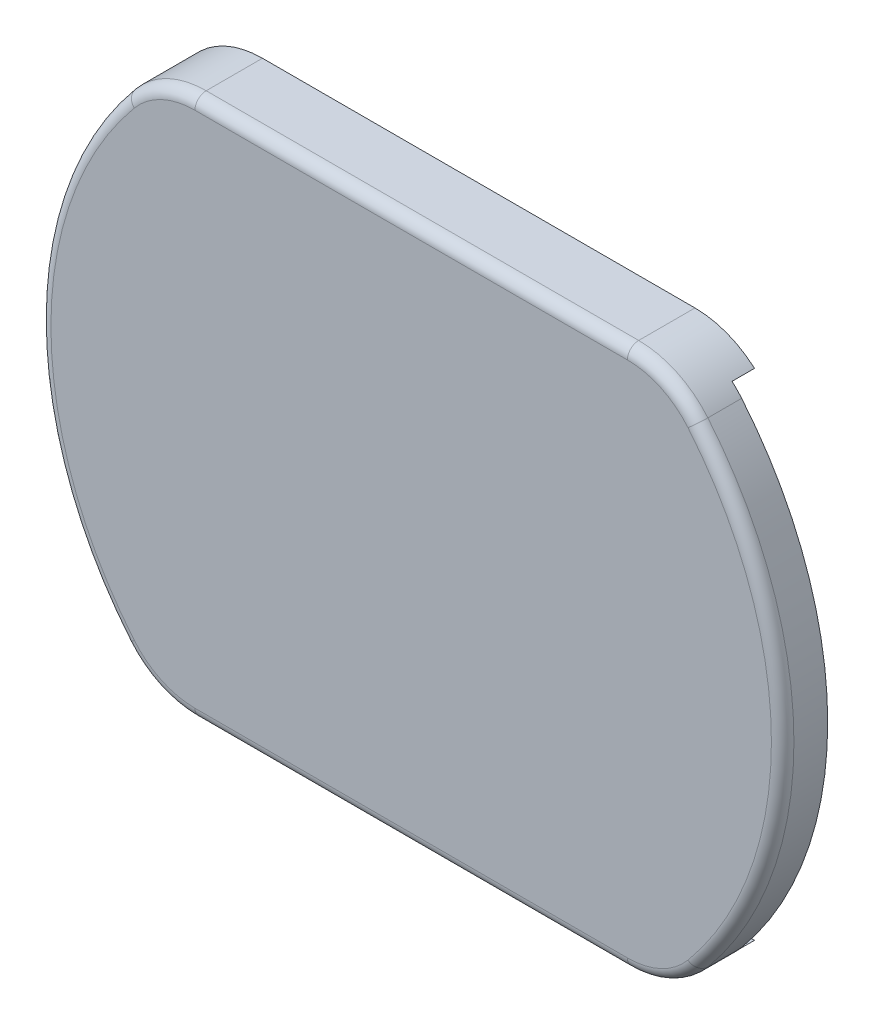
ISO-10303-21;
HEADER;
FILE_DESCRIPTION(('STEP AP214'),'2;1');
FILE_NAME('part.step','',(''),(''),'','','');
FILE_SCHEMA(('AUTOMOTIVE_DESIGN { 1 0 10303 214 1 1 1 1 }'));
ENDSEC;
DATA;
#1=APPLICATION_CONTEXT('core data for automotive mechanical design processes');
#2=APPLICATION_PROTOCOL_DEFINITION('international standard','automotive_design',2000,#1);
#3=PRODUCT_CONTEXT('',#1,'mechanical');
#4=PRODUCT('Part','Part','',(#3));
#5=PRODUCT_RELATED_PRODUCT_CATEGORY('part','',(#4));
#6=PRODUCT_DEFINITION_FORMATION('','',#4);
#7=PRODUCT_DEFINITION_CONTEXT('part definition',#1,'design');
#8=PRODUCT_DEFINITION('design','',#6,#7);
#9=PRODUCT_DEFINITION_SHAPE('','',#8);
#10=(LENGTH_UNIT() NAMED_UNIT(*) SI_UNIT(.MILLI.,.METRE.));
#11=(NAMED_UNIT(*) PLANE_ANGLE_UNIT() SI_UNIT($,.RADIAN.));
#12=(NAMED_UNIT(*) SI_UNIT($,.STERADIAN.) SOLID_ANGLE_UNIT());
#13=UNCERTAINTY_MEASURE_WITH_UNIT(LENGTH_MEASURE(1.E-05),#10,'distance_accuracy_value','');
#14=(GEOMETRIC_REPRESENTATION_CONTEXT(3) GLOBAL_UNCERTAINTY_ASSIGNED_CONTEXT((#13)) GLOBAL_UNIT_ASSIGNED_CONTEXT((#10,
#11,#12)) REPRESENTATION_CONTEXT('',''));
#15=CARTESIAN_POINT('',(0.,0.,0.));
#16=DIRECTION('',(0.,0.,1.));
#17=DIRECTION('',(1.,0.,0.));
#18=AXIS2_PLACEMENT_3D('',#15,#16,#17);
#19=CARTESIAN_POINT('',(-9.60468635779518,-10.5,1.));
#20=DIRECTION('',(0.,-1.,0.));
#21=DIRECTION('',(1.,0.,0.));
#22=AXIS2_PLACEMENT_3D('',#19,#20,#21);
#23=PLANE('',#22);
#24=DIRECTION('',(1.,0.,0.));
#25=VECTOR('',#24,1.);
#26=CARTESIAN_POINT('',(-9.5,-10.5,0.750000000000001));
#27=LINE('',#26,#25);
#28=CARTESIAN_POINT('',(-9.5,-10.5,0.750000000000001));
#29=VERTEX_POINT('',#28);
#30=CARTESIAN_POINT('',(10.5,-10.5,0.750000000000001));
#31=VERTEX_POINT('',#30);
#32=EDGE_CURVE('E698',#29,#31,#27,.T.);
#33=ORIENTED_EDGE('',*,*,#32,.T.);
#34=DIRECTION('',(0.,0.,-1.));
#35=VECTOR('',#34,1.);
#36=CARTESIAN_POINT('',(10.5,-10.5,1.));
#37=LINE('',#36,#35);
#38=CARTESIAN_POINT('',(10.5,-10.5,0.));
#39=VERTEX_POINT('',#38);
#40=EDGE_CURVE('E704',#31,#39,#37,.T.);
#41=ORIENTED_EDGE('',*,*,#40,.T.);
#42=DIRECTION('',(-1.,0.,0.));
#43=VECTOR('',#42,1.);
#44=CARTESIAN_POINT('',(-9.60468635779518,-10.5,0.));
#45=LINE('',#44,#43);
#46=CARTESIAN_POINT('',(-9.60468635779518,-10.5,0.));
#47=VERTEX_POINT('',#46);
#48=EDGE_CURVE('E249',#39,#47,#45,.T.);
#49=ORIENTED_EDGE('',*,*,#48,.T.);
#50=DIRECTION('',(0.,0.,-1.));
#51=VECTOR('',#50,1.);
#52=CARTESIAN_POINT('',(-9.60468635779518,-10.5,1.));
#53=LINE('',#52,#51);
#54=CARTESIAN_POINT('',(-9.60468635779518,-10.5,1.));
#55=VERTEX_POINT('',#54);
#56=EDGE_CURVE('E230',#55,#47,#53,.T.);
#57=ORIENTED_EDGE('',*,*,#56,.F.);
#58=DIRECTION('',(-1.,0.,0.));
#59=VECTOR('',#58,1.);
#60=CARTESIAN_POINT('',(-9.60468635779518,-10.5,1.));
#61=LINE('',#60,#59);
#62=CARTESIAN_POINT('',(-9.5,-10.5,1.));
#63=VERTEX_POINT('',#62);
#64=EDGE_CURVE('E211',#63,#55,#61,.T.);
#65=ORIENTED_EDGE('',*,*,#64,.F.);
#66=DIRECTION('',(0.,0.,-1.));
#67=VECTOR('',#66,1.);
#68=CARTESIAN_POINT('',(-9.5,-10.5,1.));
#69=LINE('',#68,#67);
#70=EDGE_CURVE('E219',#63,#29,#69,.T.);
#71=ORIENTED_EDGE('',*,*,#70,.T.);
#72=EDGE_LOOP('',(#33,#41,#49,#57,#65,#71));
#73=FACE_BOUND('',#72,.T.);
#74=ADVANCED_FACE('F32',(#73),#23,.F.);
#75=CARTESIAN_POINT('',(10.5,-11.,23.8035085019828));
#76=DIRECTION('',(-1.,0.,0.));
#77=DIRECTION('',(0.,-1.,0.));
#78=AXIS2_PLACEMENT_3D('',#75,#76,#77);
#79=PLANE('',#78);
#80=DIRECTION('',(0.,-1.,0.));
#81=VECTOR('',#80,1.);
#82=CARTESIAN_POINT('',(10.5,-10.5,0.750000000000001));
#83=LINE('',#82,#81);
#84=CARTESIAN_POINT('',(10.5,-11.,0.750000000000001));
#85=VERTEX_POINT('',#84);
#86=EDGE_CURVE('E227',#31,#85,#83,.T.);
#87=ORIENTED_EDGE('',*,*,#86,.T.);
#88=DIRECTION('',(0.,0.,-1.));
#89=VECTOR('',#88,1.);
#90=CARTESIAN_POINT('',(10.5,-11.,23.8035085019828));
#91=LINE('',#90,#89);
#92=CARTESIAN_POINT('',(10.5,-11.,0.));
#93=VERTEX_POINT('',#92);
#94=EDGE_CURVE('E716',#85,#93,#91,.T.);
#95=ORIENTED_EDGE('',*,*,#94,.T.);
#96=DIRECTION('',(0.,1.,0.));
#97=VECTOR('',#96,1.);
#98=CARTESIAN_POINT('',(10.5,-11.,0.));
#99=LINE('',#98,#97);
#100=EDGE_CURVE('E709',#93,#39,#99,.T.);
#101=ORIENTED_EDGE('',*,*,#100,.T.);
#102=ORIENTED_EDGE('',*,*,#40,.F.);
#103=EDGE_LOOP('',(#87,#95,#101,#102));
#104=FACE_BOUND('',#103,.T.);
#105=ADVANCED_FACE('F454',(#104),#79,.F.);
#106=CARTESIAN_POINT('',(0.,-1.97604641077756E-09,3.));
#107=DIRECTION('',(0.,0.,-1.));
#108=DIRECTION('',(-1.,0.,0.));
#109=AXIS2_PLACEMENT_3D('',#106,#107,#108);
#110=CYLINDRICAL_SURFACE('',#109,16.5);
#111=CARTESIAN_POINT('',(0.,-1.97604641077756E-09,1.));
#112=DIRECTION('',(0.,0.,-1.));
#113=DIRECTION('',(-1.,0.,0.));
#114=AXIS2_PLACEMENT_3D('',#111,#112,#113);
#115=CIRCLE('',#114,16.5);
#116=CARTESIAN_POINT('',(12.6781859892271,10.5600000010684,1.));
#117=VERTEX_POINT('',#116);
#118=CARTESIAN_POINT('',(12.6781859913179,-10.5599999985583,1.));
#119=VERTEX_POINT('',#118);
#120=EDGE_CURVE('E233',#117,#119,#115,.T.);
#121=ORIENTED_EDGE('',*,*,#120,.F.);
#122=DIRECTION('',(0.,0.,-1.));
#123=VECTOR('',#122,1.);
#124=CARTESIAN_POINT('',(12.6781859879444,10.5600000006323,3.));
#125=LINE('',#124,#123);
#126=CARTESIAN_POINT('',(12.6781859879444,10.5600000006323,2.5));
#127=VERTEX_POINT('',#126);
#128=EDGE_CURVE('E300',#127,#117,#125,.T.);
#129=ORIENTED_EDGE('',*,*,#128,.F.);
#130=CARTESIAN_POINT('',(0.,-1.97604641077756E-09,2.5));
#131=DIRECTION('',(0.,0.,1.));
#132=DIRECTION('',(1.,0.,0.));
#133=AXIS2_PLACEMENT_3D('',#130,#131,#132);
#134=CIRCLE('',#133,16.5);
#135=CARTESIAN_POINT('',(12.6781859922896,-10.5599999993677,2.5));
#136=VERTEX_POINT('',#135);
#137=EDGE_CURVE('E336',#127,#136,#134,.F.);
#138=ORIENTED_EDGE('',*,*,#137,.T.);
#139=DIRECTION('',(0.,0.,-1.));
#140=VECTOR('',#139,1.);
#141=CARTESIAN_POINT('',(12.6781859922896,-10.5599999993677,3.));
#142=LINE('',#141,#140);
#143=EDGE_CURVE('E303',#136,#119,#142,.T.);
#144=ORIENTED_EDGE('',*,*,#143,.T.);
#145=EDGE_LOOP('',(#121,#129,#138,#144));
#146=FACE_BOUND('',#145,.T.);
#147=ADVANCED_FACE('F374',(#146),#110,.T.);
#148=CARTESIAN_POINT('',(-9.60468635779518,-8.,3.));
#149=DIRECTION('',(0.,0.,-1.));
#150=DIRECTION('',(-1.,0.,0.));
#151=AXIS2_PLACEMENT_3D('',#148,#149,#150);
#152=CYLINDRICAL_SURFACE('',#151,3.99999999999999);
#153=DIRECTION('',(0.,0.,-1.));
#154=VECTOR('',#153,1.);
#155=CARTESIAN_POINT('',(-9.60468635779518,-12.,3.));
#156=LINE('',#155,#154);
#157=CARTESIAN_POINT('',(-9.60468635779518,-12.,2.5));
#158=VERTEX_POINT('',#157);
#159=CARTESIAN_POINT('',(-9.60468635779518,-12.,0.));
#160=VERTEX_POINT('',#159);
#161=EDGE_CURVE('E308',#158,#160,#156,.T.);
#162=ORIENTED_EDGE('',*,*,#161,.F.);
#163=CARTESIAN_POINT('',(-9.60468635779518,-8.,2.5));
#164=DIRECTION('',(0.,0.,1.));
#165=DIRECTION('',(1.,0.,0.));
#166=AXIS2_PLACEMENT_3D('',#163,#164,#165);
#167=CIRCLE('',#166,3.99999999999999);
#168=CARTESIAN_POINT('',(-12.6781859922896,-10.5599999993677,2.5));
#169=VERTEX_POINT('',#168);
#170=EDGE_CURVE('E11',#158,#169,#167,.F.);
#171=ORIENTED_EDGE('',*,*,#170,.T.);
#172=DIRECTION('',(0.,0.,-1.));
#173=VECTOR('',#172,1.);
#174=CARTESIAN_POINT('',(-12.6781859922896,-10.5599999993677,3.));
#175=LINE('',#174,#173);
#176=CARTESIAN_POINT('',(-12.6781859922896,-10.5599999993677,0.));
#177=VERTEX_POINT('',#176);
#178=EDGE_CURVE('E291',#169,#177,#175,.T.);
#179=ORIENTED_EDGE('',*,*,#178,.T.);
#180=CARTESIAN_POINT('',(-9.60468635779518,-8.,0.));
#181=DIRECTION('',(0.,0.,1.));
#182=DIRECTION('',(1.,0.,0.));
#183=AXIS2_PLACEMENT_3D('',#180,#181,#182);
#184=CIRCLE('',#183,3.99999999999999);
#185=EDGE_CURVE('E271',#177,#160,#184,.T.);
#186=ORIENTED_EDGE('',*,*,#185,.T.);
#187=EDGE_LOOP('',(#162,#171,#179,#186));
#188=FACE_BOUND('',#187,.T.);
#189=ADVANCED_FACE('F433',(#188),#152,.T.);
#190=CARTESIAN_POINT('',(-9.60468635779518,-12.,3.));
#191=DIRECTION('',(0.,1.,0.));
#192=DIRECTION('',(-1.,0.,0.));
#193=AXIS2_PLACEMENT_3D('',#190,#191,#192);
#194=PLANE('',#193);
#195=DIRECTION('',(0.,0.,-1.));
#196=VECTOR('',#195,1.);
#197=CARTESIAN_POINT('',(9.60468635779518,-12.,3.));
#198=LINE('',#197,#196);
#199=CARTESIAN_POINT('',(9.60468635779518,-12.,2.5));
#200=VERTEX_POINT('',#199);
#201=CARTESIAN_POINT('',(9.60468635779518,-12.,0.));
#202=VERTEX_POINT('',#201);
#203=EDGE_CURVE('E306',#200,#202,#198,.T.);
#204=ORIENTED_EDGE('',*,*,#203,.F.);
#205=DIRECTION('',(1.,0.,0.));
#206=VECTOR('',#205,1.);
#207=CARTESIAN_POINT('',(-9.60468635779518,-12.,2.5));
#208=LINE('',#207,#206);
#209=EDGE_CURVE('E41',#200,#158,#208,.F.);
#210=ORIENTED_EDGE('',*,*,#209,.T.);
#211=ORIENTED_EDGE('',*,*,#161,.T.);
#212=DIRECTION('',(1.,0.,0.));
#213=VECTOR('',#212,1.);
#214=CARTESIAN_POINT('',(-9.60468635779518,-12.,0.));
#215=LINE('',#214,#213);
#216=EDGE_CURVE('E274',#160,#202,#215,.T.);
#217=ORIENTED_EDGE('',*,*,#216,.T.);
#218=EDGE_LOOP('',(#204,#210,#211,#217));
#219=FACE_BOUND('',#218,.T.);
#220=ADVANCED_FACE('F484',(#219),#194,.F.);
#221=CARTESIAN_POINT('',(9.60468635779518,-8.,3.));
#222=DIRECTION('',(0.,0.,-1.));
#223=DIRECTION('',(-1.,0.,0.));
#224=AXIS2_PLACEMENT_3D('',#221,#222,#223);
#225=CYLINDRICAL_SURFACE('',#224,3.99999999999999);
#226=CARTESIAN_POINT('',(9.60468635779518,-8.,0.));
#227=DIRECTION('',(0.,0.,1.));
#228=DIRECTION('',(1.,0.,0.));
#229=AXIS2_PLACEMENT_3D('',#226,#227,#228);
#230=CIRCLE('',#229,3.99999999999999);
#231=CARTESIAN_POINT('',(12.2504376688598,-11.,0.));
#232=VERTEX_POINT('',#231);
#233=EDGE_CURVE('E277',#202,#232,#230,.T.);
#234=ORIENTED_EDGE('',*,*,#233,.T.);
#235=DIRECTION('',(0.,0.,-1.));
#236=VECTOR('',#235,1.);
#237=CARTESIAN_POINT('',(12.2504376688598,-11.,3.));
#238=LINE('',#237,#236);
#239=CARTESIAN_POINT('',(12.2504376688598,-11.,1.));
#240=VERTEX_POINT('',#239);
#241=EDGE_CURVE('E380',#232,#240,#238,.F.);
#242=ORIENTED_EDGE('',*,*,#241,.T.);
#243=CARTESIAN_POINT('',(9.60468635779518,-8.,1.));
#244=DIRECTION('',(0.,0.,-1.));
#245=DIRECTION('',(-1.,0.,0.));
#246=AXIS2_PLACEMENT_3D('',#243,#244,#245);
#247=CIRCLE('',#246,3.99999999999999);
#248=EDGE_CURVE('E379',#119,#240,#247,.T.);
#249=ORIENTED_EDGE('',*,*,#248,.F.);
#250=ORIENTED_EDGE('',*,*,#143,.F.);
#251=CARTESIAN_POINT('',(9.60468635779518,-8.,2.5));
#252=DIRECTION('',(0.,0.,1.));
#253=DIRECTION('',(1.,0.,0.));
#254=AXIS2_PLACEMENT_3D('',#251,#252,#253);
#255=CIRCLE('',#254,3.99999999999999);
#256=EDGE_CURVE('E338',#136,#200,#255,.F.);
#257=ORIENTED_EDGE('',*,*,#256,.T.);
#258=ORIENTED_EDGE('',*,*,#203,.T.);
#259=EDGE_LOOP('',(#234,#242,#249,#250,#257,#258));
#260=FACE_BOUND('',#259,.T.);
#261=ADVANCED_FACE('F377',(#260),#225,.T.);
#262=CARTESIAN_POINT('',(9.60468635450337,8.,3.));
#263=DIRECTION('',(0.,0.,-1.));
#264=DIRECTION('',(-1.,0.,0.));
#265=AXIS2_PLACEMENT_3D('',#262,#263,#264);
#266=CYLINDRICAL_SURFACE('',#265,4.);
#267=CARTESIAN_POINT('',(9.60468635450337,8.,1.));
#268=DIRECTION('',(0.,0.,-1.));
#269=DIRECTION('',(-1.,0.,0.));
#270=AXIS2_PLACEMENT_3D('',#267,#268,#269);
#271=CIRCLE('',#270,4.);
#272=CARTESIAN_POINT('',(12.250437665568,11.,1.));
#273=VERTEX_POINT('',#272);
#274=EDGE_CURVE('E381',#273,#117,#271,.T.);
#275=ORIENTED_EDGE('',*,*,#274,.F.);
#276=DIRECTION('',(0.,0.,-1.));
#277=VECTOR('',#276,1.);
#278=CARTESIAN_POINT('',(12.250437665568,11.,3.));
#279=LINE('',#278,#277);
#280=CARTESIAN_POINT('',(12.250437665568,11.,0.));
#281=VERTEX_POINT('',#280);
#282=EDGE_CURVE('E252',#273,#281,#279,.T.);
#283=ORIENTED_EDGE('',*,*,#282,.T.);
#284=CARTESIAN_POINT('',(9.60468635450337,8.,0.));
#285=DIRECTION('',(0.,0.,1.));
#286=DIRECTION('',(1.,0.,0.));
#287=AXIS2_PLACEMENT_3D('',#284,#285,#286);
#288=CIRCLE('',#287,4.);
#289=CARTESIAN_POINT('',(9.60468635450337,12.,0.));
#290=VERTEX_POINT('',#289);
#291=EDGE_CURVE('E280',#281,#290,#288,.T.);
#292=ORIENTED_EDGE('',*,*,#291,.T.);
#293=DIRECTION('',(0.,0.,-1.));
#294=VECTOR('',#293,1.);
#295=CARTESIAN_POINT('',(9.60468635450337,12.,3.));
#296=LINE('',#295,#294);
#297=CARTESIAN_POINT('',(9.60468635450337,12.,2.5));
#298=VERTEX_POINT('',#297);
#299=EDGE_CURVE('E297',#298,#290,#296,.T.);
#300=ORIENTED_EDGE('',*,*,#299,.F.);
#301=CARTESIAN_POINT('',(9.60468635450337,8.,2.5));
#302=DIRECTION('',(0.,0.,1.));
#303=DIRECTION('',(1.,0.,0.));
#304=AXIS2_PLACEMENT_3D('',#301,#302,#303);
#305=CIRCLE('',#304,4.);
#306=EDGE_CURVE('E334',#298,#127,#305,.F.);
#307=ORIENTED_EDGE('',*,*,#306,.T.);
#308=ORIENTED_EDGE('',*,*,#128,.T.);
#309=EDGE_LOOP('',(#275,#283,#292,#300,#307,#308));
#310=FACE_BOUND('',#309,.T.);
#311=ADVANCED_FACE('F392',(#310),#266,.T.);
#312=CARTESIAN_POINT('',(9.60468635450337,12.,3.));
#313=DIRECTION('',(0.,-1.,0.));
#314=DIRECTION('',(1.,0.,0.));
#315=AXIS2_PLACEMENT_3D('',#312,#313,#314);
#316=PLANE('',#315);
#317=DIRECTION('',(0.,0.,-1.));
#318=VECTOR('',#317,1.);
#319=CARTESIAN_POINT('',(-9.60468635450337,12.,3.));
#320=LINE('',#319,#318);
#321=CARTESIAN_POINT('',(-9.60468635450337,12.,2.5));
#322=VERTEX_POINT('',#321);
#323=CARTESIAN_POINT('',(-9.60468635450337,12.,0.));
#324=VERTEX_POINT('',#323);
#325=EDGE_CURVE('E295',#322,#324,#320,.T.);
#326=ORIENTED_EDGE('',*,*,#325,.F.);
#327=DIRECTION('',(-1.,0.,0.));
#328=VECTOR('',#327,1.);
#329=CARTESIAN_POINT('',(9.60468635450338,12.,2.5));
#330=LINE('',#329,#328);
#331=EDGE_CURVE('E332',#322,#298,#330,.F.);
#332=ORIENTED_EDGE('',*,*,#331,.T.);
#333=ORIENTED_EDGE('',*,*,#299,.T.);
#334=DIRECTION('',(-1.,0.,0.));
#335=VECTOR('',#334,1.);
#336=CARTESIAN_POINT('',(9.60468635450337,12.,0.));
#337=LINE('',#336,#335);
#338=EDGE_CURVE('E282',#290,#324,#337,.T.);
#339=ORIENTED_EDGE('',*,*,#338,.T.);
#340=EDGE_LOOP('',(#326,#332,#333,#339));
#341=FACE_BOUND('',#340,.T.);
#342=ADVANCED_FACE('F406',(#341),#316,.F.);
#343=CARTESIAN_POINT('',(-9.60468635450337,8.,3.));
#344=DIRECTION('',(0.,0.,-1.));
#345=DIRECTION('',(-1.,0.,0.));
#346=AXIS2_PLACEMENT_3D('',#343,#344,#345);
#347=CYLINDRICAL_SURFACE('',#346,4.);
#348=DIRECTION('',(0.,0.,-1.));
#349=VECTOR('',#348,1.);
#350=CARTESIAN_POINT('',(-12.6781859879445,10.5600000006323,3.));
#351=LINE('',#350,#349);
#352=CARTESIAN_POINT('',(-12.6781859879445,10.5600000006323,2.5));
#353=VERTEX_POINT('',#352);
#354=CARTESIAN_POINT('',(-12.6781859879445,10.5600000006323,0.));
#355=VERTEX_POINT('',#354);
#356=EDGE_CURVE('E293',#353,#355,#351,.T.);
#357=ORIENTED_EDGE('',*,*,#356,.F.);
#358=CARTESIAN_POINT('',(-9.60468635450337,8.,2.5));
#359=DIRECTION('',(0.,0.,1.));
#360=DIRECTION('',(1.,0.,0.));
#361=AXIS2_PLACEMENT_3D('',#358,#359,#360);
#362=CIRCLE('',#361,4.);
#363=EDGE_CURVE('E330',#353,#322,#362,.F.);
#364=ORIENTED_EDGE('',*,*,#363,.T.);
#365=ORIENTED_EDGE('',*,*,#325,.T.);
#366=CARTESIAN_POINT('',(-9.60468635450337,8.,0.));
#367=DIRECTION('',(0.,0.,1.));
#368=DIRECTION('',(1.,0.,0.));
#369=AXIS2_PLACEMENT_3D('',#366,#367,#368);
#370=CIRCLE('',#369,4.);
#371=EDGE_CURVE('E285',#324,#355,#370,.T.);
#372=ORIENTED_EDGE('',*,*,#371,.T.);
#373=EDGE_LOOP('',(#357,#364,#365,#372));
#374=FACE_BOUND('',#373,.T.);
#375=ADVANCED_FACE('F472',(#374),#347,.T.);
#376=CARTESIAN_POINT('',(0.,-1.97604641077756E-09,3.));
#377=DIRECTION('',(0.,0.,-1.));
#378=DIRECTION('',(-1.,0.,0.));
#379=AXIS2_PLACEMENT_3D('',#376,#377,#378);
#380=CYLINDRICAL_SURFACE('',#379,16.5);
#381=ORIENTED_EDGE('',*,*,#178,.F.);
#382=CARTESIAN_POINT('',(0.,-1.97604641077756E-09,2.5));
#383=DIRECTION('',(0.,0.,1.));
#384=DIRECTION('',(1.,0.,0.));
#385=AXIS2_PLACEMENT_3D('',#382,#383,#384);
#386=CIRCLE('',#385,16.5);
#387=EDGE_CURVE('E327',#169,#353,#386,.F.);
#388=ORIENTED_EDGE('',*,*,#387,.T.);
#389=ORIENTED_EDGE('',*,*,#356,.T.);
#390=CARTESIAN_POINT('',(0.,-1.97604641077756E-09,0.));
#391=DIRECTION('',(0.,0.,1.));
#392=DIRECTION('',(1.,0.,0.));
#393=AXIS2_PLACEMENT_3D('',#390,#391,#392);
#394=CIRCLE('',#393,16.5);
#395=EDGE_CURVE('E288',#355,#177,#394,.T.);
#396=ORIENTED_EDGE('',*,*,#395,.T.);
#397=EDGE_LOOP('',(#381,#388,#389,#396));
#398=FACE_BOUND('',#397,.T.);
#399=ADVANCED_FACE('F436',(#398),#380,.T.);
#400=CARTESIAN_POINT('',(-9.60468635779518,-8.,3.));
#401=DIRECTION('',(0.,0.,1.));
#402=DIRECTION('',(1.,0.,0.));
#403=AXIS2_PLACEMENT_3D('',#400,#401,#402);
#404=PLANE('',#403);
#405=CARTESIAN_POINT('',(-9.60468635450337,8.,3.));
#406=DIRECTION('',(0.,0.,1.));
#407=DIRECTION('',(1.,0.,0.));
#408=AXIS2_PLACEMENT_3D('',#405,#406,#407);
#409=CIRCLE('',#408,3.5);
#410=CARTESIAN_POINT('',(-9.60468635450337,11.5,3.));
#411=VERTEX_POINT('',#410);
#412=CARTESIAN_POINT('',(-12.2939985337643,10.2400000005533,3.));
#413=VERTEX_POINT('',#412);
#414=EDGE_CURVE('E322',#411,#413,#409,.T.);
#415=ORIENTED_EDGE('',*,*,#414,.T.);
#416=CARTESIAN_POINT('',(0.,-1.97604641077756E-09,3.));
#417=DIRECTION('',(0.,0.,1.));
#418=DIRECTION('',(1.,0.,0.));
#419=AXIS2_PLACEMENT_3D('',#416,#417,#418);
#420=CIRCLE('',#419,16.);
#421=CARTESIAN_POINT('',(-12.2939985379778,-10.2399999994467,3.));
#422=VERTEX_POINT('',#421);
#423=EDGE_CURVE('E324',#413,#422,#420,.T.);
#424=ORIENTED_EDGE('',*,*,#423,.T.);
#425=CARTESIAN_POINT('',(-9.60468635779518,-8.,3.));
#426=DIRECTION('',(0.,0.,1.));
#427=DIRECTION('',(1.,0.,0.));
#428=AXIS2_PLACEMENT_3D('',#425,#426,#427);
#429=CIRCLE('',#428,3.49999999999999);
#430=CARTESIAN_POINT('',(-9.60468635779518,-11.5,3.));
#431=VERTEX_POINT('',#430);
#432=EDGE_CURVE('E310',#422,#431,#429,.T.);
#433=ORIENTED_EDGE('',*,*,#432,.T.);
#434=DIRECTION('',(1.,0.,0.));
#435=VECTOR('',#434,1.);
#436=CARTESIAN_POINT('',(9.60468635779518,-11.5,3.));
#437=LINE('',#436,#435);
#438=CARTESIAN_POINT('',(9.60468635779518,-11.5,3.));
#439=VERTEX_POINT('',#438);
#440=EDGE_CURVE('E312',#431,#439,#437,.T.);
#441=ORIENTED_EDGE('',*,*,#440,.T.);
#442=CARTESIAN_POINT('',(9.60468635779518,-8.,3.));
#443=DIRECTION('',(0.,0.,1.));
#444=DIRECTION('',(1.,0.,0.));
#445=AXIS2_PLACEMENT_3D('',#442,#443,#444);
#446=CIRCLE('',#445,3.49999999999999);
#447=CARTESIAN_POINT('',(12.2939985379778,-10.2399999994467,3.));
#448=VERTEX_POINT('',#447);
#449=EDGE_CURVE('E314',#439,#448,#446,.T.);
#450=ORIENTED_EDGE('',*,*,#449,.T.);
#451=CARTESIAN_POINT('',(0.,-1.97604641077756E-09,3.));
#452=DIRECTION('',(0.,0.,1.));
#453=DIRECTION('',(1.,0.,0.));
#454=AXIS2_PLACEMENT_3D('',#451,#452,#453);
#455=CIRCLE('',#454,16.);
#456=CARTESIAN_POINT('',(12.2939985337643,10.2400000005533,3.));
#457=VERTEX_POINT('',#456);
#458=EDGE_CURVE('E316',#448,#457,#455,.T.);
#459=ORIENTED_EDGE('',*,*,#458,.T.);
#460=CARTESIAN_POINT('',(9.60468635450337,8.,3.));
#461=DIRECTION('',(0.,0.,1.));
#462=DIRECTION('',(1.,0.,0.));
#463=AXIS2_PLACEMENT_3D('',#460,#461,#462);
#464=CIRCLE('',#463,3.5);
#465=CARTESIAN_POINT('',(9.60468635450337,11.5,3.));
#466=VERTEX_POINT('',#465);
#467=EDGE_CURVE('E318',#457,#466,#464,.T.);
#468=ORIENTED_EDGE('',*,*,#467,.T.);
#469=DIRECTION('',(-1.,0.,0.));
#470=VECTOR('',#469,1.);
#471=CARTESIAN_POINT('',(-9.60468635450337,11.5,3.));
#472=LINE('',#471,#470);
#473=EDGE_CURVE('E320',#466,#411,#472,.T.);
#474=ORIENTED_EDGE('',*,*,#473,.T.);
#475=EDGE_LOOP('',(#415,#424,#433,#441,#450,#459,#468,#474));
#476=FACE_BOUND('',#475,.T.);
#477=ADVANCED_FACE('F419',(#476),#404,.T.);
#478=CARTESIAN_POINT('',(-9.60468635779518,-8.,0.));
#479=DIRECTION('',(0.,0.,1.));
#480=DIRECTION('',(1.,0.,0.));
#481=AXIS2_PLACEMENT_3D('',#478,#479,#480);
#482=PLANE('',#481);
#483=ORIENTED_EDGE('',*,*,#291,.F.);
#484=DIRECTION('',(1.,0.,0.));
#485=VECTOR('',#484,1.);
#486=CARTESIAN_POINT('',(10.5,11.,0.));
#487=LINE('',#486,#485);
#488=CARTESIAN_POINT('',(10.5,11.,0.));
#489=VERTEX_POINT('',#488);
#490=EDGE_CURVE('E401',#489,#281,#487,.T.);
#491=ORIENTED_EDGE('',*,*,#490,.F.);
#492=CARTESIAN_POINT('',(10.5,10.5,0.));
#493=VERTEX_POINT('',#492);
#494=EDGE_CURVE('E721',#493,#489,#99,.T.);
#495=ORIENTED_EDGE('',*,*,#494,.F.);
#496=DIRECTION('',(1.,0.,0.));
#497=VECTOR('',#496,1.);
#498=CARTESIAN_POINT('',(-9.60468635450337,10.5,0.));
#499=LINE('',#498,#497);
#500=CARTESIAN_POINT('',(-9.60468635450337,10.5,0.));
#501=VERTEX_POINT('',#500);
#502=EDGE_CURVE('E237',#501,#493,#499,.T.);
#503=ORIENTED_EDGE('',*,*,#502,.F.);
#504=CARTESIAN_POINT('',(-9.60468635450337,8.,0.));
#505=DIRECTION('',(0.,0.,-1.));
#506=DIRECTION('',(-1.,0.,0.));
#507=AXIS2_PLACEMENT_3D('',#504,#505,#506);
#508=CIRCLE('',#507,2.5);
#509=CARTESIAN_POINT('',(-11.525623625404,9.60000000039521,0.));
#510=VERTEX_POINT('',#509);
#511=EDGE_CURVE('E258',#510,#501,#508,.T.);
#512=ORIENTED_EDGE('',*,*,#511,.F.);
#513=CARTESIAN_POINT('',(0.,-1.97604641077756E-09,0.));
#514=DIRECTION('',(0.,0.,-1.));
#515=DIRECTION('',(-1.,0.,0.));
#516=AXIS2_PLACEMENT_3D('',#513,#514,#515);
#517=CIRCLE('',#516,15.);
#518=CARTESIAN_POINT('',(-11.5256236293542,-9.59999999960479,0.));
#519=VERTEX_POINT('',#518);
#520=EDGE_CURVE('E255',#519,#510,#517,.T.);
#521=ORIENTED_EDGE('',*,*,#520,.F.);
#522=CARTESIAN_POINT('',(-9.60468635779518,-8.,0.));
#523=DIRECTION('',(0.,0.,-1.));
#524=DIRECTION('',(-1.,0.,0.));
#525=AXIS2_PLACEMENT_3D('',#522,#523,#524);
#526=CIRCLE('',#525,2.5);
#527=EDGE_CURVE('E251',#47,#519,#526,.T.);
#528=ORIENTED_EDGE('',*,*,#527,.F.);
#529=ORIENTED_EDGE('',*,*,#48,.F.);
#530=ORIENTED_EDGE('',*,*,#100,.F.);
#531=DIRECTION('',(-1.,0.,0.));
#532=VECTOR('',#531,1.);
#533=CARTESIAN_POINT('',(12.2983738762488,-11.,0.));
#534=LINE('',#533,#532);
#535=EDGE_CURVE('E722',#232,#93,#534,.T.);
#536=ORIENTED_EDGE('',*,*,#535,.F.);
#537=ORIENTED_EDGE('',*,*,#233,.F.);
#538=ORIENTED_EDGE('',*,*,#216,.F.);
#539=ORIENTED_EDGE('',*,*,#185,.F.);
#540=ORIENTED_EDGE('',*,*,#395,.F.);
#541=ORIENTED_EDGE('',*,*,#371,.F.);
#542=ORIENTED_EDGE('',*,*,#338,.F.);
#543=EDGE_LOOP('',(#483,#491,#495,#503,#512,#521,#528,#529,#530,#536,#537,#538,#539,#540,#541,#542));
#544=FACE_BOUND('',#543,.T.);
#545=ADVANCED_FACE('F399',(#544),#482,.F.);
#546=CARTESIAN_POINT('',(0.,-1.97604641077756E-09,2.5));
#547=DIRECTION('',(0.,0.,1.));
#548=DIRECTION('',(1.,0.,0.));
#549=AXIS2_PLACEMENT_3D('',#546,#547,#548);
#550=TOROIDAL_SURFACE('',#549,16.,0.5);
#551=CARTESIAN_POINT('',(12.2939985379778,-10.2399999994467,2.5));
#552=DIRECTION('',(-0.639999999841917,-0.768374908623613,0.));
#553=DIRECTION('',(0.768374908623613,-0.639999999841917,0.));
#554=AXIS2_PLACEMENT_3D('',#551,#552,#553);
#555=CIRCLE('',#554,0.5);
#556=EDGE_CURVE('E355',#136,#448,#555,.T.);
#557=ORIENTED_EDGE('',*,*,#556,.F.);
#558=ORIENTED_EDGE('',*,*,#137,.F.);
#559=CARTESIAN_POINT('',(12.2939985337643,10.2400000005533,2.5));
#560=DIRECTION('',(-0.640000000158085,0.768374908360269,0.));
#561=DIRECTION('',(-0.768374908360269,-0.640000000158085,0.));
#562=AXIS2_PLACEMENT_3D('',#559,#560,#561);
#563=CIRCLE('',#562,0.5);
#564=EDGE_CURVE('E36',#457,#127,#563,.T.);
#565=ORIENTED_EDGE('',*,*,#564,.F.);
#566=ORIENTED_EDGE('',*,*,#458,.F.);
#567=EDGE_LOOP('',(#557,#558,#565,#566));
#568=FACE_BOUND('',#567,.T.);
#569=ADVANCED_FACE('F34',(#568),#550,.T.);
#570=CARTESIAN_POINT('',(9.60468635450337,8.,2.5));
#571=DIRECTION('',(0.,0.,1.));
#572=DIRECTION('',(1.,0.,0.));
#573=AXIS2_PLACEMENT_3D('',#570,#571,#572);
#574=TOROIDAL_SURFACE('',#573,3.5,0.5);
#575=ORIENTED_EDGE('',*,*,#564,.T.);
#576=ORIENTED_EDGE('',*,*,#306,.F.);
#577=CARTESIAN_POINT('',(9.60468635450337,11.5,2.5));
#578=DIRECTION('',(-1.,0.,0.));
#579=DIRECTION('',(0.,0.,1.));
#580=AXIS2_PLACEMENT_3D('',#577,#578,#579);
#581=CIRCLE('',#580,0.5);
#582=EDGE_CURVE('E353',#466,#298,#581,.T.);
#583=ORIENTED_EDGE('',*,*,#582,.F.);
#584=ORIENTED_EDGE('',*,*,#467,.F.);
#585=EDGE_LOOP('',(#575,#576,#583,#584));
#586=FACE_BOUND('',#585,.T.);
#587=ADVANCED_FACE('F366',(#586),#574,.T.);
#588=CARTESIAN_POINT('',(9.60468635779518,-8.,2.5));
#589=DIRECTION('',(0.,0.,1.));
#590=DIRECTION('',(1.,0.,0.));
#591=AXIS2_PLACEMENT_3D('',#588,#589,#590);
#592=TOROIDAL_SURFACE('',#591,3.49999999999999,0.5);
#593=ORIENTED_EDGE('',*,*,#556,.T.);
#594=ORIENTED_EDGE('',*,*,#449,.F.);
#595=CARTESIAN_POINT('',(9.60468635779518,-11.5,2.5));
#596=DIRECTION('',(-1.,0.,0.));
#597=DIRECTION('',(0.,0.,1.));
#598=AXIS2_PLACEMENT_3D('',#595,#596,#597);
#599=CIRCLE('',#598,0.5);
#600=EDGE_CURVE('E350',#200,#439,#599,.T.);
#601=ORIENTED_EDGE('',*,*,#600,.F.);
#602=ORIENTED_EDGE('',*,*,#256,.F.);
#603=EDGE_LOOP('',(#593,#594,#601,#602));
#604=FACE_BOUND('',#603,.T.);
#605=ADVANCED_FACE('F422',(#604),#592,.T.);
#606=CARTESIAN_POINT('',(-9.60468635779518,11.5,2.5));
#607=DIRECTION('',(1.,0.,0.));
#608=DIRECTION('',(0.,1.,0.));
#609=AXIS2_PLACEMENT_3D('',#606,#607,#608);
#610=CYLINDRICAL_SURFACE('',#609,0.5);
#611=ORIENTED_EDGE('',*,*,#582,.T.);
#612=ORIENTED_EDGE('',*,*,#331,.F.);
#613=CARTESIAN_POINT('',(-9.60468635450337,11.5,2.5));
#614=DIRECTION('',(-1.,0.,0.));
#615=DIRECTION('',(0.,0.,1.));
#616=AXIS2_PLACEMENT_3D('',#613,#614,#615);
#617=CIRCLE('',#616,0.5);
#618=EDGE_CURVE('E347',#411,#322,#617,.T.);
#619=ORIENTED_EDGE('',*,*,#618,.F.);
#620=ORIENTED_EDGE('',*,*,#473,.F.);
#621=EDGE_LOOP('',(#611,#612,#619,#620));
#622=FACE_BOUND('',#621,.T.);
#623=ADVANCED_FACE('F410',(#622),#610,.T.);
#624=CARTESIAN_POINT('',(-9.60468635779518,-11.5,2.5));
#625=DIRECTION('',(-1.,0.,0.));
#626=DIRECTION('',(0.,-1.,0.));
#627=AXIS2_PLACEMENT_3D('',#624,#625,#626);
#628=CYLINDRICAL_SURFACE('',#627,0.5);
#629=ORIENTED_EDGE('',*,*,#600,.T.);
#630=ORIENTED_EDGE('',*,*,#440,.F.);
#631=CARTESIAN_POINT('',(-9.60468635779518,-11.5,2.5));
#632=DIRECTION('',(-1.,0.,0.));
#633=DIRECTION('',(0.,0.,1.));
#634=AXIS2_PLACEMENT_3D('',#631,#632,#633);
#635=CIRCLE('',#634,0.5);
#636=EDGE_CURVE('E344',#158,#431,#635,.T.);
#637=ORIENTED_EDGE('',*,*,#636,.F.);
#638=ORIENTED_EDGE('',*,*,#209,.F.);
#639=EDGE_LOOP('',(#629,#630,#637,#638));
#640=FACE_BOUND('',#639,.T.);
#641=ADVANCED_FACE('F424',(#640),#628,.T.);
#642=CARTESIAN_POINT('',(-9.60468635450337,8.,2.5));
#643=DIRECTION('',(0.,0.,1.));
#644=DIRECTION('',(1.,0.,0.));
#645=AXIS2_PLACEMENT_3D('',#642,#643,#644);
#646=TOROIDAL_SURFACE('',#645,3.5,0.5);
#647=ORIENTED_EDGE('',*,*,#618,.T.);
#648=ORIENTED_EDGE('',*,*,#363,.F.);
#649=CARTESIAN_POINT('',(-12.2939985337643,10.2400000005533,2.5));
#650=DIRECTION('',(-0.640000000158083,-0.76837490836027,0.));
#651=DIRECTION('',(0.76837490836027,-0.640000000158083,0.));
#652=AXIS2_PLACEMENT_3D('',#649,#650,#651);
#653=CIRCLE('',#652,0.5);
#654=EDGE_CURVE('E342',#413,#353,#653,.T.);
#655=ORIENTED_EDGE('',*,*,#654,.F.);
#656=ORIENTED_EDGE('',*,*,#414,.F.);
#657=EDGE_LOOP('',(#647,#648,#655,#656));
#658=FACE_BOUND('',#657,.T.);
#659=ADVANCED_FACE('F415',(#658),#646,.T.);
#660=CARTESIAN_POINT('',(-9.60468635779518,-8.,2.5));
#661=DIRECTION('',(0.,0.,1.));
#662=DIRECTION('',(1.,0.,0.));
#663=AXIS2_PLACEMENT_3D('',#660,#661,#662);
#664=TOROIDAL_SURFACE('',#663,3.49999999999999,0.5);
#665=ORIENTED_EDGE('',*,*,#636,.T.);
#666=ORIENTED_EDGE('',*,*,#432,.F.);
#667=CARTESIAN_POINT('',(-12.2939985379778,-10.2399999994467,2.5));
#668=DIRECTION('',(-0.639999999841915,0.768374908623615,0.));
#669=DIRECTION('',(-0.768374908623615,-0.639999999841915,0.));
#670=AXIS2_PLACEMENT_3D('',#667,#668,#669);
#671=CIRCLE('',#670,0.5);
#672=EDGE_CURVE('E265',#169,#422,#671,.T.);
#673=ORIENTED_EDGE('',*,*,#672,.F.);
#674=ORIENTED_EDGE('',*,*,#170,.F.);
#675=EDGE_LOOP('',(#665,#666,#673,#674));
#676=FACE_BOUND('',#675,.T.);
#677=ADVANCED_FACE('F430',(#676),#664,.T.);
#678=CARTESIAN_POINT('',(0.,-1.97604641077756E-09,2.5));
#679=DIRECTION('',(0.,0.,1.));
#680=DIRECTION('',(1.,0.,0.));
#681=AXIS2_PLACEMENT_3D('',#678,#679,#680);
#682=TOROIDAL_SURFACE('',#681,16.,0.5);
#683=ORIENTED_EDGE('',*,*,#654,.T.);
#684=ORIENTED_EDGE('',*,*,#387,.F.);
#685=ORIENTED_EDGE('',*,*,#672,.T.);
#686=ORIENTED_EDGE('',*,*,#423,.F.);
#687=EDGE_LOOP('',(#683,#684,#685,#686));
#688=FACE_BOUND('',#687,.T.);
#689=ADVANCED_FACE('F440',(#688),#682,.T.);
#690=CARTESIAN_POINT('',(-9.60468635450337,10.5,1.));
#691=DIRECTION('',(0.,1.,0.));
#692=DIRECTION('',(-1.,0.,0.));
#693=AXIS2_PLACEMENT_3D('',#690,#691,#692);
#694=PLANE('',#693);
#695=DIRECTION('',(0.,0.,1.));
#696=VECTOR('',#695,1.);
#697=CARTESIAN_POINT('',(10.5,10.5,1.));
#698=LINE('',#697,#696);
#699=CARTESIAN_POINT('',(10.5,10.5,0.750000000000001));
#700=VERTEX_POINT('',#699);
#701=EDGE_CURVE('E385',#493,#700,#698,.T.);
#702=ORIENTED_EDGE('',*,*,#701,.T.);
#703=DIRECTION('',(1.,0.,0.));
#704=VECTOR('',#703,1.);
#705=CARTESIAN_POINT('',(-9.5,10.5,0.750000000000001));
#706=LINE('',#705,#704);
#707=CARTESIAN_POINT('',(-9.5,10.5,0.750000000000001));
#708=VERTEX_POINT('',#707);
#709=EDGE_CURVE('E49',#708,#700,#706,.T.);
#710=ORIENTED_EDGE('',*,*,#709,.F.);
#711=DIRECTION('',(0.,0.,-1.));
#712=VECTOR('',#711,1.);
#713=CARTESIAN_POINT('',(-9.5,10.5,1.));
#714=LINE('',#713,#712);
#715=CARTESIAN_POINT('',(-9.5,10.5,1.));
#716=VERTEX_POINT('',#715);
#717=EDGE_CURVE('E732',#716,#708,#714,.T.);
#718=ORIENTED_EDGE('',*,*,#717,.F.);
#719=DIRECTION('',(1.,0.,0.));
#720=VECTOR('',#719,1.);
#721=CARTESIAN_POINT('',(-9.60468635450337,10.5,1.));
#722=LINE('',#721,#720);
#723=CARTESIAN_POINT('',(-9.60468635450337,10.5,1.));
#724=VERTEX_POINT('',#723);
#725=EDGE_CURVE('E246',#724,#716,#722,.T.);
#726=ORIENTED_EDGE('',*,*,#725,.F.);
#727=DIRECTION('',(0.,0.,-1.));
#728=VECTOR('',#727,1.);
#729=CARTESIAN_POINT('',(-9.60468635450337,10.5,1.));
#730=LINE('',#729,#728);
#731=EDGE_CURVE('E263',#724,#501,#730,.T.);
#732=ORIENTED_EDGE('',*,*,#731,.T.);
#733=ORIENTED_EDGE('',*,*,#502,.T.);
#734=EDGE_LOOP('',(#702,#710,#718,#726,#732,#733));
#735=FACE_BOUND('',#734,.T.);
#736=ADVANCED_FACE('F442',(#735),#694,.F.);
#737=CARTESIAN_POINT('',(-9.60468635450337,8.,1.));
#738=DIRECTION('',(0.,0.,-1.));
#739=DIRECTION('',(-1.,0.,0.));
#740=AXIS2_PLACEMENT_3D('',#737,#738,#739);
#741=CYLINDRICAL_SURFACE('',#740,2.5);
#742=ORIENTED_EDGE('',*,*,#511,.T.);
#743=ORIENTED_EDGE('',*,*,#731,.F.);
#744=CARTESIAN_POINT('',(-9.60468635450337,8.,1.));
#745=DIRECTION('',(0.,0.,-1.));
#746=DIRECTION('',(-1.,0.,0.));
#747=AXIS2_PLACEMENT_3D('',#744,#745,#746);
#748=CIRCLE('',#747,2.5);
#749=CARTESIAN_POINT('',(-11.525623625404,9.60000000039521,1.));
#750=VERTEX_POINT('',#749);
#751=EDGE_CURVE('E243',#750,#724,#748,.T.);
#752=ORIENTED_EDGE('',*,*,#751,.F.);
#753=DIRECTION('',(0.,0.,-1.));
#754=VECTOR('',#753,1.);
#755=CARTESIAN_POINT('',(-11.525623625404,9.60000000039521,1.));
#756=LINE('',#755,#754);
#757=EDGE_CURVE('E266',#750,#510,#756,.T.);
#758=ORIENTED_EDGE('',*,*,#757,.T.);
#759=EDGE_LOOP('',(#742,#743,#752,#758));
#760=FACE_BOUND('',#759,.T.);
#761=ADVANCED_FACE('F448',(#760),#741,.F.);
#762=CARTESIAN_POINT('',(0.,-1.97604641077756E-09,1.));
#763=DIRECTION('',(0.,0.,-1.));
#764=DIRECTION('',(-1.,0.,0.));
#765=AXIS2_PLACEMENT_3D('',#762,#763,#764);
#766=CYLINDRICAL_SURFACE('',#765,15.);
#767=ORIENTED_EDGE('',*,*,#520,.T.);
#768=ORIENTED_EDGE('',*,*,#757,.F.);
#769=CARTESIAN_POINT('',(0.,-1.97604641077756E-09,1.));
#770=DIRECTION('',(0.,0.,-1.));
#771=DIRECTION('',(-1.,0.,0.));
#772=AXIS2_PLACEMENT_3D('',#769,#770,#771);
#773=CIRCLE('',#772,15.);
#774=CARTESIAN_POINT('',(-11.5256236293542,-9.59999999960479,1.));
#775=VERTEX_POINT('',#774);
#776=EDGE_CURVE('E235',#775,#750,#773,.T.);
#777=ORIENTED_EDGE('',*,*,#776,.F.);
#778=DIRECTION('',(0.,0.,-1.));
#779=VECTOR('',#778,1.);
#780=CARTESIAN_POINT('',(-11.5256236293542,-9.59999999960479,1.));
#781=LINE('',#780,#779);
#782=EDGE_CURVE('E268',#775,#519,#781,.T.);
#783=ORIENTED_EDGE('',*,*,#782,.T.);
#784=EDGE_LOOP('',(#767,#768,#777,#783));
#785=FACE_BOUND('',#784,.T.);
#786=ADVANCED_FACE('F576',(#785),#766,.F.);
#787=CARTESIAN_POINT('',(-9.60468635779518,-8.,1.));
#788=DIRECTION('',(0.,0.,-1.));
#789=DIRECTION('',(-1.,0.,0.));
#790=AXIS2_PLACEMENT_3D('',#787,#788,#789);
#791=CYLINDRICAL_SURFACE('',#790,2.5);
#792=ORIENTED_EDGE('',*,*,#527,.T.);
#793=ORIENTED_EDGE('',*,*,#782,.F.);
#794=CARTESIAN_POINT('',(-9.60468635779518,-8.,1.));
#795=DIRECTION('',(0.,0.,-1.));
#796=DIRECTION('',(-1.,0.,0.));
#797=AXIS2_PLACEMENT_3D('',#794,#795,#796);
#798=CIRCLE('',#797,2.5);
#799=EDGE_CURVE('E232',#55,#775,#798,.T.);
#800=ORIENTED_EDGE('',*,*,#799,.F.);
#801=ORIENTED_EDGE('',*,*,#56,.T.);
#802=EDGE_LOOP('',(#792,#793,#800,#801));
#803=FACE_BOUND('',#802,.T.);
#804=ADVANCED_FACE('F464',(#803),#791,.F.);
#805=CARTESIAN_POINT('',(0.,-1.97604641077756E-09,1.));
#806=DIRECTION('',(0.,0.,-1.));
#807=DIRECTION('',(-1.,0.,0.));
#808=AXIS2_PLACEMENT_3D('',#805,#806,#807);
#809=PLANE('',#808);
#810=DIRECTION('',(0.,1.,0.));
#811=VECTOR('',#810,1.);
#812=CARTESIAN_POINT('',(-9.5,-11.,1.));
#813=LINE('',#812,#811);
#814=CARTESIAN_POINT('',(-9.5,-11.,1.));
#815=VERTEX_POINT('',#814);
#816=EDGE_CURVE('E206',#815,#63,#813,.T.);
#817=ORIENTED_EDGE('',*,*,#816,.T.);
#818=ORIENTED_EDGE('',*,*,#64,.T.);
#819=ORIENTED_EDGE('',*,*,#799,.T.);
#820=ORIENTED_EDGE('',*,*,#776,.T.);
#821=ORIENTED_EDGE('',*,*,#751,.T.);
#822=ORIENTED_EDGE('',*,*,#725,.T.);
#823=DIRECTION('',(0.,-1.,0.));
#824=VECTOR('',#823,1.);
#825=CARTESIAN_POINT('',(-9.5,11.,1.));
#826=LINE('',#825,#824);
#827=CARTESIAN_POINT('',(-9.5,11.,1.));
#828=VERTEX_POINT('',#827);
#829=EDGE_CURVE('E729',#828,#716,#826,.T.);
#830=ORIENTED_EDGE('',*,*,#829,.F.);
#831=DIRECTION('',(-1.,0.,0.));
#832=VECTOR('',#831,1.);
#833=CARTESIAN_POINT('',(10.5,11.,1.));
#834=LINE('',#833,#832);
#835=EDGE_CURVE('E711',#273,#828,#834,.T.);
#836=ORIENTED_EDGE('',*,*,#835,.F.);
#837=ORIENTED_EDGE('',*,*,#274,.T.);
#838=ORIENTED_EDGE('',*,*,#120,.T.);
#839=ORIENTED_EDGE('',*,*,#248,.T.);
#840=DIRECTION('',(1.,0.,0.));
#841=VECTOR('',#840,1.);
#842=CARTESIAN_POINT('',(12.2983738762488,-11.,1.));
#843=LINE('',#842,#841);
#844=EDGE_CURVE('E214',#815,#240,#843,.T.);
#845=ORIENTED_EDGE('',*,*,#844,.F.);
#846=EDGE_LOOP('',(#817,#818,#819,#820,#821,#822,#830,#836,#837,#838,#839,#845));
#847=FACE_BOUND('',#846,.T.);
#848=ADVANCED_FACE('F208',(#847),#809,.T.);
#849=CARTESIAN_POINT('',(12.2983738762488,-11.,23.8035085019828));
#850=DIRECTION('',(0.,-1.,0.));
#851=DIRECTION('',(0.,0.,-1.));
#852=AXIS2_PLACEMENT_3D('',#849,#850,#851);
#853=PLANE('',#852);
#854=ORIENTED_EDGE('',*,*,#535,.T.);
#855=ORIENTED_EDGE('',*,*,#94,.F.);
#856=DIRECTION('',(1.,0.,0.));
#857=VECTOR('',#856,1.);
#858=CARTESIAN_POINT('',(-9.5,-11.,0.750000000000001));
#859=LINE('',#858,#857);
#860=CARTESIAN_POINT('',(-9.5,-11.,0.750000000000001));
#861=VERTEX_POINT('',#860);
#862=EDGE_CURVE('E700',#861,#85,#859,.T.);
#863=ORIENTED_EDGE('',*,*,#862,.F.);
#864=DIRECTION('',(0.,0.,1.));
#865=VECTOR('',#864,1.);
#866=CARTESIAN_POINT('',(-9.5,-11.,0.750000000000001));
#867=LINE('',#866,#865);
#868=EDGE_CURVE('E218',#861,#815,#867,.T.);
#869=ORIENTED_EDGE('',*,*,#868,.T.);
#870=ORIENTED_EDGE('',*,*,#844,.T.);
#871=ORIENTED_EDGE('',*,*,#241,.F.);
#872=EDGE_LOOP('',(#854,#855,#863,#869,#870,#871));
#873=FACE_BOUND('',#872,.T.);
#874=ADVANCED_FACE('F610',(#873),#853,.F.);
#875=CARTESIAN_POINT('',(10.5,11.,23.8035085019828));
#876=DIRECTION('',(0.,1.,0.));
#877=DIRECTION('',(0.,0.,1.));
#878=AXIS2_PLACEMENT_3D('',#875,#876,#877);
#879=PLANE('',#878);
#880=ORIENTED_EDGE('',*,*,#835,.T.);
#881=DIRECTION('',(0.,0.,1.));
#882=VECTOR('',#881,1.);
#883=CARTESIAN_POINT('',(-9.5,11.,0.750000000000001));
#884=LINE('',#883,#882);
#885=CARTESIAN_POINT('',(-9.5,11.,0.750000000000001));
#886=VERTEX_POINT('',#885);
#887=EDGE_CURVE('E734',#886,#828,#884,.T.);
#888=ORIENTED_EDGE('',*,*,#887,.F.);
#889=DIRECTION('',(1.,0.,0.));
#890=VECTOR('',#889,1.);
#891=CARTESIAN_POINT('',(-9.5,11.,0.750000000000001));
#892=LINE('',#891,#890);
#893=CARTESIAN_POINT('',(10.5,11.,0.750000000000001));
#894=VERTEX_POINT('',#893);
#895=EDGE_CURVE('E725',#886,#894,#892,.T.);
#896=ORIENTED_EDGE('',*,*,#895,.T.);
#897=DIRECTION('',(0.,0.,-1.));
#898=VECTOR('',#897,1.);
#899=CARTESIAN_POINT('',(10.5,11.,23.8035085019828));
#900=LINE('',#899,#898);
#901=EDGE_CURVE('E718',#894,#489,#900,.T.);
#902=ORIENTED_EDGE('',*,*,#901,.T.);
#903=ORIENTED_EDGE('',*,*,#490,.T.);
#904=ORIENTED_EDGE('',*,*,#282,.F.);
#905=EDGE_LOOP('',(#880,#888,#896,#902,#903,#904));
#906=FACE_BOUND('',#905,.T.);
#907=ADVANCED_FACE('F622',(#906),#879,.F.);
#908=ORIENTED_EDGE('',*,*,#901,.F.);
#909=DIRECTION('',(0.,1.,0.));
#910=VECTOR('',#909,1.);
#911=CARTESIAN_POINT('',(10.5,10.5,0.750000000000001));
#912=LINE('',#911,#910);
#913=EDGE_CURVE('E706',#700,#894,#912,.T.);
#914=ORIENTED_EDGE('',*,*,#913,.F.);
#915=ORIENTED_EDGE('',*,*,#701,.F.);
#916=ORIENTED_EDGE('',*,*,#494,.T.);
#917=EDGE_LOOP('',(#908,#914,#915,#916));
#918=FACE_BOUND('',#917,.T.);
#919=ADVANCED_FACE('F461',(#918),#79,.F.);
#920=CARTESIAN_POINT('',(-9.5,10.5,0.750000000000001));
#921=DIRECTION('',(0.,0.,-1.));
#922=DIRECTION('',(-1.,0.,0.));
#923=AXIS2_PLACEMENT_3D('',#920,#921,#922);
#924=PLANE('',#923);
#925=ORIENTED_EDGE('',*,*,#913,.T.);
#926=ORIENTED_EDGE('',*,*,#895,.F.);
#927=DIRECTION('',(0.,1.,0.));
#928=VECTOR('',#927,1.);
#929=CARTESIAN_POINT('',(-9.5,10.5,0.750000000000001));
#930=LINE('',#929,#928);
#931=EDGE_CURVE('E737',#708,#886,#930,.T.);
#932=ORIENTED_EDGE('',*,*,#931,.F.);
#933=ORIENTED_EDGE('',*,*,#709,.T.);
#934=EDGE_LOOP('',(#925,#926,#932,#933));
#935=FACE_BOUND('',#934,.T.);
#936=ADVANCED_FACE('F641',(#935),#924,.F.);
#937=CARTESIAN_POINT('',(-9.5,10.5,0.750000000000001));
#938=DIRECTION('',(1.,0.,0.));
#939=DIRECTION('',(0.,0.,-1.));
#940=AXIS2_PLACEMENT_3D('',#937,#938,#939);
#941=PLANE('',#940);
#942=ORIENTED_EDGE('',*,*,#717,.T.);
#943=ORIENTED_EDGE('',*,*,#931,.T.);
#944=ORIENTED_EDGE('',*,*,#887,.T.);
#945=ORIENTED_EDGE('',*,*,#829,.T.);
#946=EDGE_LOOP('',(#942,#943,#944,#945));
#947=FACE_BOUND('',#946,.T.);
#948=ADVANCED_FACE('F650',(#947),#941,.T.);
#949=CARTESIAN_POINT('',(-9.5,-10.5,0.750000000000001));
#950=DIRECTION('',(0.,0.,1.));
#951=DIRECTION('',(1.,0.,0.));
#952=AXIS2_PLACEMENT_3D('',#949,#950,#951);
#953=PLANE('',#952);
#954=ORIENTED_EDGE('',*,*,#86,.F.);
#955=ORIENTED_EDGE('',*,*,#32,.F.);
#956=DIRECTION('',(0.,-1.,0.));
#957=VECTOR('',#956,1.);
#958=CARTESIAN_POINT('',(-9.5,-10.5,0.750000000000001));
#959=LINE('',#958,#957);
#960=EDGE_CURVE('E223',#29,#861,#959,.T.);
#961=ORIENTED_EDGE('',*,*,#960,.T.);
#962=ORIENTED_EDGE('',*,*,#862,.T.);
#963=EDGE_LOOP('',(#954,#955,#961,#962));
#964=FACE_BOUND('',#963,.T.);
#965=ADVANCED_FACE('F658',(#964),#953,.T.);
#966=CARTESIAN_POINT('',(-9.5,-10.5,0.750000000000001));
#967=DIRECTION('',(1.,0.,0.));
#968=DIRECTION('',(0.,0.,-1.));
#969=AXIS2_PLACEMENT_3D('',#966,#967,#968);
#970=PLANE('',#969);
#971=ORIENTED_EDGE('',*,*,#70,.F.);
#972=ORIENTED_EDGE('',*,*,#816,.F.);
#973=ORIENTED_EDGE('',*,*,#868,.F.);
#974=ORIENTED_EDGE('',*,*,#960,.F.);
#975=EDGE_LOOP('',(#971,#972,#973,#974));
#976=FACE_BOUND('',#975,.T.);
#977=ADVANCED_FACE('F222',(#976),#970,.T.);
#978=CLOSED_SHELL('',(#74,#105,#147,#189,#220,#261,#311,#342,#375,#399,#477,#545,#569,#587,#605,
#623,#641,#659,#677,#689,#736,#761,#786,#804,#848,#874,#907,#919,#936,#948,#965,#977));
#979=MANIFOLD_SOLID_BREP('B2',#978);
#980=ADVANCED_BREP_SHAPE_REPRESENTATION('',(#18,#979),#14);
#981=SHAPE_DEFINITION_REPRESENTATION(#9,#980);
ENDSEC;
END-ISO-10303-21;
